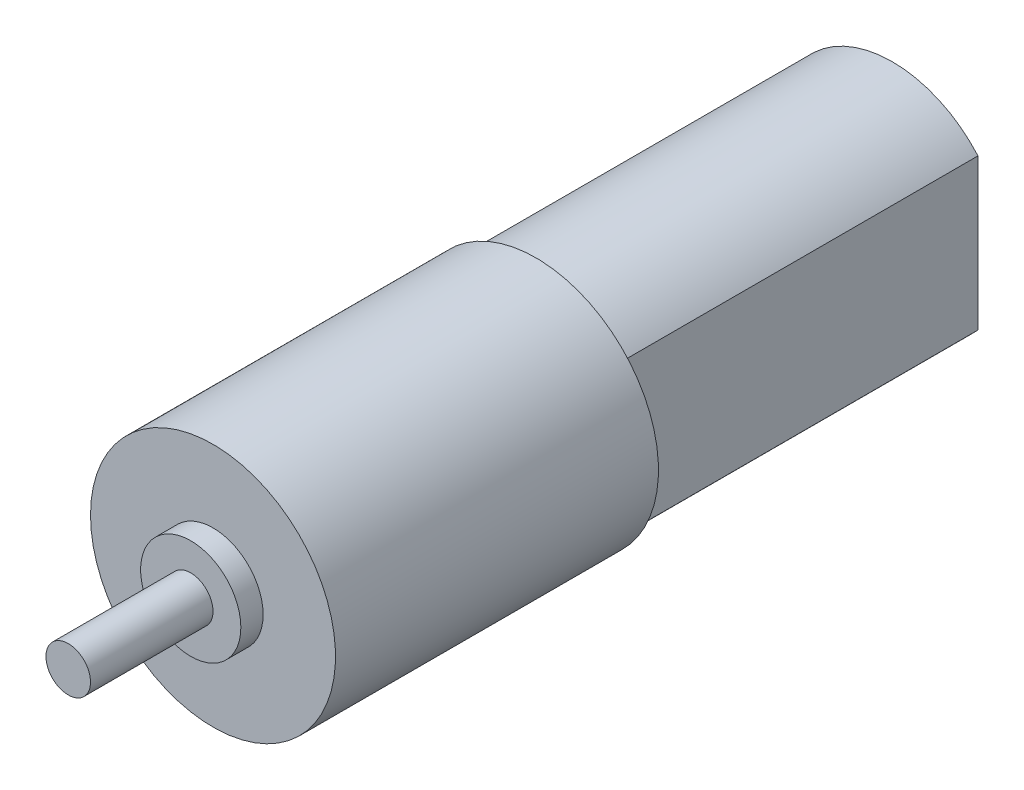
from build123d import *

# Parameters (mm, degrees)
ESQUISSE1_R             = 11
BOSS_EXTRU_1_DEPTH      = 61
ESQUISSE2_R             = 4.5
BOSS_EXTRU_2_DEPTH      = 2
ESQUISSE3_R             = 2
BOSS_EXTRU_3_DEPTH      = 11
ESQUISSE6_W             = 9.206151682
ESQUISSE6_H             = 15.5
ESQUISSE6_W_2           = 7.142703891
ESQUISSE6_H_2           = 15.723380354
ENL_V_MAT_EXTRU_2_DEPTH = 32
ESQUISSE7_OUTSIDE_W     = 40.054
ESQUISSE7_OUTSIDE_H     = 40.054
ESQUISSE7_OUTSIDE_R     = 10.25
ENL_V_MAT_EXTRU_3_DEPTH = 32


with BuildPart() as part:
    # Esquisse1 → Boss.-Extru.1 (new body)
    with BuildSketch(Plane.XY):
        with Locations(Location((0, 0, 0), (0, 0, 180))):
            Circle(ESQUISSE1_R)
    extrude(amount=BOSS_EXTRU_1_DEPTH)

    # Esquisse2 → Boss.-Extru.2 (add)
    with BuildSketch(Plane.XY.offset(61)):
        Circle(ESQUISSE2_R)
    extrude(amount=BOSS_EXTRU_2_DEPTH)

    # Esquisse3 → Boss.-Extru.3 (add)
    with BuildSketch(Plane.XY.offset(63)):
        Circle(ESQUISSE3_R)
    extrude(amount=BOSS_EXTRU_3_DEPTH)

    # Esquisse6 → Enl_v. mat.-Extru.2 (cut)
    with BuildSketch(Plane(origin=(0, 0, 0), x_dir=(-1, 0, 0), z_dir=(0, 0, -1))):
        with Locations((12.409323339, 0)):
            Rectangle(ESQUISSE6_W, ESQUISSE6_H)
        with Locations((-11.265104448, 0)):
            Rectangle(ESQUISSE6_W_2, ESQUISSE6_H_2)
    extrude(amount=-ENL_V_MAT_EXTRU_2_DEPTH, mode=Mode.SUBTRACT)

    # Esquisse7 outside → Enl_v. mat.-Extru.3 (cut)
    with BuildSketch(Plane(origin=(0, 0, 0), x_dir=(-1, 0, 0), z_dir=(0, 0, -1))):
        Rectangle(ESQUISSE7_OUTSIDE_W, ESQUISSE7_OUTSIDE_H)
        Circle(ESQUISSE7_OUTSIDE_R, mode=Mode.SUBTRACT)
    extrude(amount=-ENL_V_MAT_EXTRU_3_DEPTH, mode=Mode.SUBTRACT)


solid = part.part
